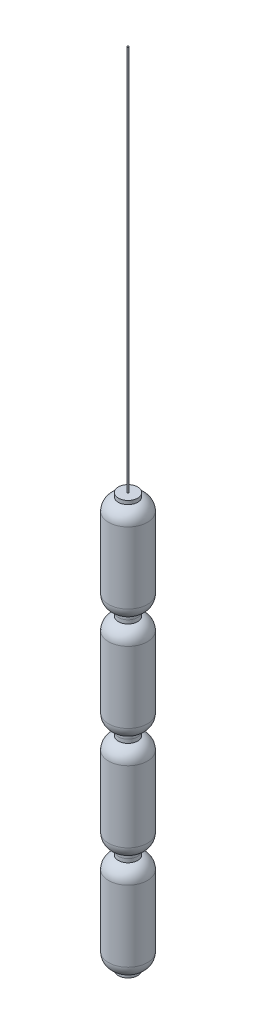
ISO-10303-21;
HEADER;
FILE_DESCRIPTION(('STEP AP214'),'2;1');
FILE_NAME('part.step','',(''),(''),'','','');
FILE_SCHEMA(('AUTOMOTIVE_DESIGN { 1 0 10303 214 1 1 1 1 }'));
ENDSEC;
DATA;
#1=APPLICATION_CONTEXT('core data for automotive mechanical design processes');
#2=APPLICATION_PROTOCOL_DEFINITION('international standard','automotive_design',2000,#1);
#3=PRODUCT_CONTEXT('',#1,'mechanical');
#4=PRODUCT('Part','Part','',(#3));
#5=PRODUCT_RELATED_PRODUCT_CATEGORY('part','',(#4));
#6=PRODUCT_DEFINITION_FORMATION('','',#4);
#7=PRODUCT_DEFINITION_CONTEXT('part definition',#1,'design');
#8=PRODUCT_DEFINITION('design','',#6,#7);
#9=PRODUCT_DEFINITION_SHAPE('','',#8);
#10=(LENGTH_UNIT() NAMED_UNIT(*) SI_UNIT(.MILLI.,.METRE.));
#11=(NAMED_UNIT(*) PLANE_ANGLE_UNIT() SI_UNIT($,.RADIAN.));
#12=(NAMED_UNIT(*) SI_UNIT($,.STERADIAN.) SOLID_ANGLE_UNIT());
#13=UNCERTAINTY_MEASURE_WITH_UNIT(LENGTH_MEASURE(1.E-05),#10,'distance_accuracy_value','');
#14=(GEOMETRIC_REPRESENTATION_CONTEXT(3) GLOBAL_UNCERTAINTY_ASSIGNED_CONTEXT((#13)) GLOBAL_UNIT_ASSIGNED_CONTEXT((#10,
#11,#12)) REPRESENTATION_CONTEXT('',''));
#15=CARTESIAN_POINT('',(0.,0.,0.));
#16=DIRECTION('',(0.,0.,1.));
#17=DIRECTION('',(1.,0.,0.));
#18=AXIS2_PLACEMENT_3D('',#15,#16,#17);
#19=CARTESIAN_POINT('',(0.,2465.,0.));
#20=DIRECTION('',(0.,-1.,0.));
#21=DIRECTION('',(0.,0.,-1.));
#22=AXIS2_PLACEMENT_3D('',#19,#20,#21);
#23=CYLINDRICAL_SURFACE('',#22,2.5);
#24=CARTESIAN_POINT('',(0.,2465.,0.));
#25=DIRECTION('',(0.,1.,0.));
#26=DIRECTION('',(0.,0.,1.));
#27=AXIS2_PLACEMENT_3D('',#24,#25,#26);
#28=CIRCLE('',#27,2.5);
#29=CARTESIAN_POINT('',(0.,2465.,2.5));
#30=VERTEX_POINT('',#29);
#31=EDGE_CURVE('E11',#30,#30,#28,.T.);
#32=ORIENTED_EDGE('',*,*,#31,.F.);
#33=EDGE_LOOP('',(#32));
#34=FACE_BOUND('',#33,.T.);
#35=CARTESIAN_POINT('',(0.,965.,0.));
#36=DIRECTION('',(0.,1.,0.));
#37=DIRECTION('',(0.,0.,1.));
#38=AXIS2_PLACEMENT_3D('',#35,#36,#37);
#39=CIRCLE('',#38,2.5);
#40=CARTESIAN_POINT('',(0.,965.,2.5));
#41=VERTEX_POINT('',#40);
#42=EDGE_CURVE('E53',#41,#41,#39,.T.);
#43=ORIENTED_EDGE('',*,*,#42,.T.);
#44=EDGE_LOOP('',(#43));
#45=FACE_BOUND('',#44,.T.);
#46=ADVANCED_FACE('F50',(#34,#45),#23,.T.);
#47=CARTESIAN_POINT('',(0.,2465.,0.));
#48=DIRECTION('',(0.,1.,0.));
#49=DIRECTION('',(0.,0.,1.));
#50=AXIS2_PLACEMENT_3D('',#47,#48,#49);
#51=PLANE('',#50);
#52=ORIENTED_EDGE('',*,*,#31,.T.);
#53=EDGE_LOOP('',(#52));
#54=FACE_BOUND('',#53,.T.);
#55=ADVANCED_FACE('F65',(#54),#51,.T.);
#56=CARTESIAN_POINT('',(0.,965.,0.));
#57=DIRECTION('',(0.,1.,0.));
#58=DIRECTION('',(0.,0.,1.));
#59=AXIS2_PLACEMENT_3D('',#56,#57,#58);
#60=PLANE('',#59);
#61=ORIENTED_EDGE('',*,*,#42,.F.);
#62=EDGE_LOOP('',(#61));
#63=FACE_BOUND('',#62,.T.);
#64=ADVANCED_FACE('F63',(#63),#60,.F.);
#65=CLOSED_SHELL('',(#46,#55,#64));
#66=MANIFOLD_SOLID_BREP('B2',#65);
#67=CARTESIAN_POINT('',(0.,1270.,0.));
#68=DIRECTION('',(0.,-1.,0.));
#69=DIRECTION('',(0.,0.,-1.));
#70=AXIS2_PLACEMENT_3D('',#67,#68,#69);
#71=CYLINDRICAL_SURFACE('',#70,30.);
#72=CARTESIAN_POINT('',(0.,1270.,0.));
#73=DIRECTION('',(0.,1.,0.));
#74=DIRECTION('',(0.,0.,1.));
#75=AXIS2_PLACEMENT_3D('',#72,#73,#74);
#76=CIRCLE('',#75,30.);
#77=CARTESIAN_POINT('',(0.,1270.,30.));
#78=VERTEX_POINT('',#77);
#79=EDGE_CURVE('E111',#78,#78,#76,.T.);
#80=ORIENTED_EDGE('',*,*,#79,.F.);
#81=EDGE_LOOP('',(#80));
#82=FACE_BOUND('',#81,.T.);
#83=CARTESIAN_POINT('',(0.,1258.72983346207,0.));
#84=DIRECTION('',(0.,-1.,0.));
#85=DIRECTION('',(0.,0.,-1.));
#86=AXIS2_PLACEMENT_3D('',#83,#84,#85);
#87=CIRCLE('',#86,30.);
#88=CARTESIAN_POINT('',(0.,1258.72983346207,-30.));
#89=VERTEX_POINT('',#88);
#90=EDGE_CURVE('E115',#89,#89,#87,.F.);
#91=ORIENTED_EDGE('',*,*,#90,.T.);
#92=EDGE_LOOP('',(#91));
#93=FACE_BOUND('',#92,.T.);
#94=ADVANCED_FACE('F105',(#82,#93),#71,.T.);
#95=CARTESIAN_POINT('',(0.,1270.,0.));
#96=DIRECTION('',(0.,1.,0.));
#97=DIRECTION('',(0.,0.,1.));
#98=AXIS2_PLACEMENT_3D('',#95,#96,#97);
#99=PLANE('',#98);
#100=ORIENTED_EDGE('',*,*,#79,.T.);
#101=EDGE_LOOP('',(#100));
#102=FACE_BOUND('',#101,.T.);
#103=ADVANCED_FACE('F126',(#102),#99,.T.);
#104=CARTESIAN_POINT('',(0.,1220.,0.));
#105=DIRECTION('',(0.,-1.,0.));
#106=DIRECTION('',(0.,0.,-1.));
#107=AXIS2_PLACEMENT_3D('',#104,#105,#106);
#108=DEGENERATE_TOROIDAL_SURFACE('',#107,20.,40.,.T.);
#109=ORIENTED_EDGE('',*,*,#90,.F.);
#110=EDGE_LOOP('',(#109));
#111=FACE_BOUND('',#110,.T.);
#112=CARTESIAN_POINT('',(0.,1260.,0.));
#113=DIRECTION('',(0.,-1.,0.));
#114=DIRECTION('',(0.,0.,-1.));
#115=AXIS2_PLACEMENT_3D('',#112,#113,#114);
#116=CIRCLE('',#115,20.);
#117=CARTESIAN_POINT('',(0.,1260.,-20.));
#118=VERTEX_POINT('',#117);
#119=EDGE_CURVE('E49',#118,#118,#116,.F.);
#120=ORIENTED_EDGE('',*,*,#119,.T.);
#121=EDGE_LOOP('',(#120));
#122=FACE_BOUND('',#121,.T.);
#123=ADVANCED_FACE('F123',(#111,#122),#108,.F.);
#124=CARTESIAN_POINT('',(0.,1260.,0.));
#125=DIRECTION('',(0.,1.,0.));
#126=DIRECTION('',(0.,0.,1.));
#127=AXIS2_PLACEMENT_3D('',#124,#125,#126);
#128=PLANE('',#127);
#129=ORIENTED_EDGE('',*,*,#119,.F.);
#130=EDGE_LOOP('',(#129));
#131=FACE_BOUND('',#130,.T.);
#132=ADVANCED_FACE('F125',(#131),#128,.F.);
#133=CLOSED_SHELL('',(#94,#103,#123,#132));
#134=MANIFOLD_SOLID_BREP('B6',#133);
#135=CARTESIAN_POINT('',(0.,950.,0.));
#136=DIRECTION('',(0.,-1.,0.));
#137=DIRECTION('',(0.,0.,-1.));
#138=AXIS2_PLACEMENT_3D('',#135,#136,#137);
#139=CYLINDRICAL_SURFACE('',#138,30.);
#140=CARTESIAN_POINT('',(0.,950.,0.));
#141=DIRECTION('',(0.,1.,0.));
#142=DIRECTION('',(0.,0.,1.));
#143=AXIS2_PLACEMENT_3D('',#140,#141,#142);
#144=CIRCLE('',#143,30.);
#145=CARTESIAN_POINT('',(0.,950.,30.));
#146=VERTEX_POINT('',#145);
#147=EDGE_CURVE('E180',#146,#146,#144,.T.);
#148=ORIENTED_EDGE('',*,*,#147,.F.);
#149=EDGE_LOOP('',(#148));
#150=FACE_BOUND('',#149,.T.);
#151=CARTESIAN_POINT('',(0.,938.729833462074,0.));
#152=DIRECTION('',(0.,-1.,0.));
#153=DIRECTION('',(0.,0.,-1.));
#154=AXIS2_PLACEMENT_3D('',#151,#152,#153);
#155=CIRCLE('',#154,30.);
#156=CARTESIAN_POINT('',(0.,938.729833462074,-30.));
#157=VERTEX_POINT('',#156);
#158=EDGE_CURVE('E184',#157,#157,#155,.F.);
#159=ORIENTED_EDGE('',*,*,#158,.T.);
#160=EDGE_LOOP('',(#159));
#161=FACE_BOUND('',#160,.T.);
#162=ADVANCED_FACE('F169',(#150,#161),#139,.T.);
#163=CARTESIAN_POINT('',(0.,950.,0.));
#164=DIRECTION('',(0.,1.,0.));
#165=DIRECTION('',(0.,0.,1.));
#166=AXIS2_PLACEMENT_3D('',#163,#164,#165);
#167=PLANE('',#166);
#168=CARTESIAN_POINT('',(0.,950.,0.));
#169=DIRECTION('',(0.,1.,0.));
#170=DIRECTION('',(0.,0.,1.));
#171=AXIS2_PLACEMENT_3D('',#168,#169,#170);
#172=CIRCLE('',#171,5.);
#173=CARTESIAN_POINT('',(0.,950.,5.));
#174=VERTEX_POINT('',#173);
#175=EDGE_CURVE('E104',#174,#174,#172,.T.);
#176=ORIENTED_EDGE('',*,*,#175,.F.);
#177=EDGE_LOOP('',(#176));
#178=FACE_BOUND('',#177,.T.);
#179=ORIENTED_EDGE('',*,*,#147,.T.);
#180=EDGE_LOOP('',(#179));
#181=FACE_BOUND('',#180,.T.);
#182=ADVANCED_FACE('F189',(#178,#181),#167,.T.);
#183=CARTESIAN_POINT('',(0.,900.,0.));
#184=DIRECTION('',(0.,-1.,0.));
#185=DIRECTION('',(0.,0.,-1.));
#186=AXIS2_PLACEMENT_3D('',#183,#184,#185);
#187=DEGENERATE_TOROIDAL_SURFACE('',#186,20.,40.,.T.);
#188=ORIENTED_EDGE('',*,*,#158,.F.);
#189=EDGE_LOOP('',(#188));
#190=FACE_BOUND('',#189,.T.);
#191=CARTESIAN_POINT('',(0.,940.,0.));
#192=DIRECTION('',(0.,-1.,0.));
#193=DIRECTION('',(0.,0.,-1.));
#194=AXIS2_PLACEMENT_3D('',#191,#192,#193);
#195=CIRCLE('',#194,20.);
#196=CARTESIAN_POINT('',(0.,940.,-20.));
#197=VERTEX_POINT('',#196);
#198=EDGE_CURVE('E172',#197,#197,#195,.F.);
#199=ORIENTED_EDGE('',*,*,#198,.T.);
#200=EDGE_LOOP('',(#199));
#201=FACE_BOUND('',#200,.T.);
#202=ADVANCED_FACE('F195',(#190,#201),#187,.F.);
#203=CARTESIAN_POINT('',(0.,940.,0.));
#204=DIRECTION('',(0.,1.,0.));
#205=DIRECTION('',(0.,0.,1.));
#206=AXIS2_PLACEMENT_3D('',#203,#204,#205);
#207=PLANE('',#206);
#208=ORIENTED_EDGE('',*,*,#198,.F.);
#209=EDGE_LOOP('',(#208));
#210=FACE_BOUND('',#209,.T.);
#211=ADVANCED_FACE('F198',(#210),#207,.F.);
#212=CARTESIAN_POINT('',(0.,965.,0.));
#213=DIRECTION('',(0.,-1.,0.));
#214=DIRECTION('',(0.,0.,-1.));
#215=AXIS2_PLACEMENT_3D('',#212,#213,#214);
#216=CYLINDRICAL_SURFACE('',#215,5.);
#217=CARTESIAN_POINT('',(0.,965.,0.));
#218=DIRECTION('',(0.,1.,0.));
#219=DIRECTION('',(0.,0.,1.));
#220=AXIS2_PLACEMENT_3D('',#217,#218,#219);
#221=CIRCLE('',#220,5.);
#222=CARTESIAN_POINT('',(0.,965.,5.));
#223=VERTEX_POINT('',#222);
#224=EDGE_CURVE('E183',#223,#223,#221,.T.);
#225=ORIENTED_EDGE('',*,*,#224,.F.);
#226=EDGE_LOOP('',(#225));
#227=FACE_BOUND('',#226,.T.);
#228=ORIENTED_EDGE('',*,*,#175,.T.);
#229=EDGE_LOOP('',(#228));
#230=FACE_BOUND('',#229,.T.);
#231=ADVANCED_FACE('F203',(#227,#230),#216,.T.);
#232=CARTESIAN_POINT('',(0.,965.,0.));
#233=DIRECTION('',(0.,1.,0.));
#234=DIRECTION('',(0.,0.,1.));
#235=AXIS2_PLACEMENT_3D('',#232,#233,#234);
#236=PLANE('',#235);
#237=ORIENTED_EDGE('',*,*,#224,.T.);
#238=EDGE_LOOP('',(#237));
#239=FACE_BOUND('',#238,.T.);
#240=ADVANCED_FACE('F207',(#239),#236,.T.);
#241=CLOSED_SHELL('',(#162,#182,#202,#211,#231,#240));
#242=MANIFOLD_SOLID_BREP('B44',#241);
#243=CARTESIAN_POINT('',(0.,630.,0.));
#244=DIRECTION('',(0.,-1.,0.));
#245=DIRECTION('',(0.,0.,-1.));
#246=AXIS2_PLACEMENT_3D('',#243,#244,#245);
#247=CYLINDRICAL_SURFACE('',#246,30.);
#248=CARTESIAN_POINT('',(0.,630.,0.));
#249=DIRECTION('',(0.,1.,0.));
#250=DIRECTION('',(0.,0.,1.));
#251=AXIS2_PLACEMENT_3D('',#248,#249,#250);
#252=CIRCLE('',#251,30.);
#253=CARTESIAN_POINT('',(0.,630.,30.));
#254=VERTEX_POINT('',#253);
#255=EDGE_CURVE('E273',#254,#254,#252,.T.);
#256=ORIENTED_EDGE('',*,*,#255,.F.);
#257=EDGE_LOOP('',(#256));
#258=FACE_BOUND('',#257,.T.);
#259=CARTESIAN_POINT('',(0.,618.729833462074,0.));
#260=DIRECTION('',(0.,-1.,0.));
#261=DIRECTION('',(0.,0.,-1.));
#262=AXIS2_PLACEMENT_3D('',#259,#260,#261);
#263=CIRCLE('',#262,30.);
#264=CARTESIAN_POINT('',(0.,618.729833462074,-30.));
#265=VERTEX_POINT('',#264);
#266=EDGE_CURVE('E277',#265,#265,#263,.F.);
#267=ORIENTED_EDGE('',*,*,#266,.T.);
#268=EDGE_LOOP('',(#267));
#269=FACE_BOUND('',#268,.T.);
#270=ADVANCED_FACE('F267',(#258,#269),#247,.T.);
#271=CARTESIAN_POINT('',(0.,630.,0.));
#272=DIRECTION('',(0.,1.,0.));
#273=DIRECTION('',(0.,0.,1.));
#274=AXIS2_PLACEMENT_3D('',#271,#272,#273);
#275=PLANE('',#274);
#276=ORIENTED_EDGE('',*,*,#255,.T.);
#277=EDGE_LOOP('',(#276));
#278=FACE_BOUND('',#277,.T.);
#279=ADVANCED_FACE('F288',(#278),#275,.T.);
#280=CARTESIAN_POINT('',(0.,580.,0.));
#281=DIRECTION('',(0.,-1.,0.));
#282=DIRECTION('',(0.,0.,-1.));
#283=AXIS2_PLACEMENT_3D('',#280,#281,#282);
#284=DEGENERATE_TOROIDAL_SURFACE('',#283,20.,40.,.T.);
#285=ORIENTED_EDGE('',*,*,#266,.F.);
#286=EDGE_LOOP('',(#285));
#287=FACE_BOUND('',#286,.T.);
#288=CARTESIAN_POINT('',(0.,620.,0.));
#289=DIRECTION('',(0.,-1.,0.));
#290=DIRECTION('',(0.,0.,-1.));
#291=AXIS2_PLACEMENT_3D('',#288,#289,#290);
#292=CIRCLE('',#291,20.);
#293=CARTESIAN_POINT('',(0.,620.,-20.));
#294=VERTEX_POINT('',#293);
#295=EDGE_CURVE('E168',#294,#294,#292,.F.);
#296=ORIENTED_EDGE('',*,*,#295,.T.);
#297=EDGE_LOOP('',(#296));
#298=FACE_BOUND('',#297,.T.);
#299=ADVANCED_FACE('F285',(#287,#298),#284,.F.);
#300=CARTESIAN_POINT('',(0.,620.,0.));
#301=DIRECTION('',(0.,1.,0.));
#302=DIRECTION('',(0.,0.,1.));
#303=AXIS2_PLACEMENT_3D('',#300,#301,#302);
#304=PLANE('',#303);
#305=ORIENTED_EDGE('',*,*,#295,.F.);
#306=EDGE_LOOP('',(#305));
#307=FACE_BOUND('',#306,.T.);
#308=ADVANCED_FACE('F287',(#307),#304,.F.);
#309=CLOSED_SHELL('',(#270,#279,#299,#308));
#310=MANIFOLD_SOLID_BREP('B99',#309);
#311=CARTESIAN_POINT('',(-20.,1260.,0.));
#312=DIRECTION('',(0.,-1.,0.));
#313=DIRECTION('',(0.,0.,-1.));
#314=AXIS2_PLACEMENT_3D('',#311,#312,#313);
#315=PLANE('',#314);
#316=CARTESIAN_POINT('',(0.,1260.,0.));
#317=DIRECTION('',(0.,-1.,0.));
#318=DIRECTION('',(0.,0.,-1.));
#319=AXIS2_PLACEMENT_3D('',#316,#317,#318);
#320=CIRCLE('',#319,20.);
#321=CARTESIAN_POINT('',(0.,1260.,-20.));
#322=VERTEX_POINT('',#321);
#323=EDGE_CURVE('E266',#322,#322,#320,.T.);
#324=ORIENTED_EDGE('',*,*,#323,.F.);
#325=EDGE_LOOP('',(#324));
#326=FACE_BOUND('',#325,.T.);
#327=ADVANCED_FACE('F331',(#326),#315,.F.);
#328=CARTESIAN_POINT('',(0.,1220.,0.));
#329=DIRECTION('',(0.,-1.,0.));
#330=DIRECTION('',(0.,0.,-1.));
#331=AXIS2_PLACEMENT_3D('',#328,#329,#330);
#332=DEGENERATE_TOROIDAL_SURFACE('',#331,20.,40.,.T.);
#333=CARTESIAN_POINT('',(0.,1220.,0.));
#334=DIRECTION('',(0.,-1.,0.));
#335=DIRECTION('',(0.,0.,-1.));
#336=AXIS2_PLACEMENT_3D('',#333,#334,#335);
#337=CIRCLE('',#336,60.);
#338=CARTESIAN_POINT('',(0.,1220.,-60.));
#339=VERTEX_POINT('',#338);
#340=EDGE_CURVE('E337',#339,#339,#337,.T.);
#341=ORIENTED_EDGE('',*,*,#340,.F.);
#342=EDGE_LOOP('',(#341));
#343=FACE_BOUND('',#342,.T.);
#344=ORIENTED_EDGE('',*,*,#323,.T.);
#345=EDGE_LOOP('',(#344));
#346=FACE_BOUND('',#345,.T.);
#347=ADVANCED_FACE('F374',(#343,#346),#332,.T.);
#348=CARTESIAN_POINT('',(0.,960.,0.));
#349=DIRECTION('',(0.,-1.,0.));
#350=DIRECTION('',(0.,0.,-1.));
#351=AXIS2_PLACEMENT_3D('',#348,#349,#350);
#352=CYLINDRICAL_SURFACE('',#351,60.);
#353=CARTESIAN_POINT('',(0.,1000.,0.));
#354=DIRECTION('',(0.,-1.,0.));
#355=DIRECTION('',(0.,0.,-1.));
#356=AXIS2_PLACEMENT_3D('',#353,#354,#355);
#357=CIRCLE('',#356,60.);
#358=CARTESIAN_POINT('',(0.,1000.,-60.));
#359=VERTEX_POINT('',#358);
#360=EDGE_CURVE('E341',#359,#359,#357,.T.);
#361=ORIENTED_EDGE('',*,*,#360,.F.);
#362=EDGE_LOOP('',(#361));
#363=FACE_BOUND('',#362,.T.);
#364=ORIENTED_EDGE('',*,*,#340,.T.);
#365=EDGE_LOOP('',(#364));
#366=FACE_BOUND('',#365,.T.);
#367=ADVANCED_FACE('F369',(#363,#366),#352,.T.);
#368=CARTESIAN_POINT('',(0.,1000.,0.));
#369=DIRECTION('',(0.,-1.,0.));
#370=DIRECTION('',(0.,0.,-1.));
#371=AXIS2_PLACEMENT_3D('',#368,#369,#370);
#372=DEGENERATE_TOROIDAL_SURFACE('',#371,20.,40.,.T.);
#373=CARTESIAN_POINT('',(0.,960.,0.));
#374=DIRECTION('',(0.,-1.,0.));
#375=DIRECTION('',(0.,0.,-1.));
#376=AXIS2_PLACEMENT_3D('',#373,#374,#375);
#377=CIRCLE('',#376,20.);
#378=CARTESIAN_POINT('',(0.,960.,-20.));
#379=VERTEX_POINT('',#378);
#380=EDGE_CURVE('E355',#379,#379,#377,.T.);
#381=ORIENTED_EDGE('',*,*,#380,.F.);
#382=EDGE_LOOP('',(#381));
#383=FACE_BOUND('',#382,.T.);
#384=ORIENTED_EDGE('',*,*,#360,.T.);
#385=EDGE_LOOP('',(#384));
#386=FACE_BOUND('',#385,.T.);
#387=ADVANCED_FACE('F366',(#383,#386),#372,.T.);
#388=CARTESIAN_POINT('',(0.,960.,0.));
#389=DIRECTION('',(0.,1.,0.));
#390=DIRECTION('',(0.,0.,1.));
#391=AXIS2_PLACEMENT_3D('',#388,#389,#390);
#392=CYLINDRICAL_SURFACE('',#391,20.);
#393=ORIENTED_EDGE('',*,*,#380,.T.);
#394=EDGE_LOOP('',(#393));
#395=FACE_BOUND('',#394,.T.);
#396=CARTESIAN_POINT('',(0.,968.,0.));
#397=DIRECTION('',(0.,1.,0.));
#398=DIRECTION('',(0.,0.,1.));
#399=AXIS2_PLACEMENT_3D('',#396,#397,#398);
#400=CIRCLE('',#399,20.);
#401=CARTESIAN_POINT('',(0.,968.,20.));
#402=VERTEX_POINT('',#401);
#403=EDGE_CURVE('E345',#402,#402,#400,.F.);
#404=ORIENTED_EDGE('',*,*,#403,.F.);
#405=EDGE_LOOP('',(#404));
#406=FACE_BOUND('',#405,.T.);
#407=ADVANCED_FACE('F363',(#395,#406),#392,.F.);
#408=CARTESIAN_POINT('',(-20.,1252.,0.));
#409=DIRECTION('',(0.,-1.,0.));
#410=DIRECTION('',(0.,0.,-1.));
#411=AXIS2_PLACEMENT_3D('',#408,#409,#410);
#412=PLANE('',#411);
#413=CARTESIAN_POINT('',(0.,1252.,0.));
#414=DIRECTION('',(0.,-1.,0.));
#415=DIRECTION('',(0.,0.,-1.));
#416=AXIS2_PLACEMENT_3D('',#413,#414,#415);
#417=CIRCLE('',#416,20.);
#418=CARTESIAN_POINT('',(0.,1252.,-20.));
#419=VERTEX_POINT('',#418);
#420=EDGE_CURVE('E350',#419,#419,#417,.T.);
#421=ORIENTED_EDGE('',*,*,#420,.T.);
#422=EDGE_LOOP('',(#421));
#423=FACE_BOUND('',#422,.T.);
#424=ADVANCED_FACE('F407',(#423),#412,.T.);
#425=CARTESIAN_POINT('',(0.,1220.,0.));
#426=DIRECTION('',(0.,-1.,0.));
#427=DIRECTION('',(0.,0.,-1.));
#428=AXIS2_PLACEMENT_3D('',#425,#426,#427);
#429=DEGENERATE_TOROIDAL_SURFACE('',#428,20.,32.,.T.);
#430=CARTESIAN_POINT('',(0.,1220.,0.));
#431=DIRECTION('',(0.,-1.,0.));
#432=DIRECTION('',(0.,0.,-1.));
#433=AXIS2_PLACEMENT_3D('',#430,#431,#432);
#434=CIRCLE('',#433,52.);
#435=CARTESIAN_POINT('',(0.,1220.,-52.));
#436=VERTEX_POINT('',#435);
#437=EDGE_CURVE('E354',#436,#436,#434,.T.);
#438=ORIENTED_EDGE('',*,*,#437,.T.);
#439=EDGE_LOOP('',(#438));
#440=FACE_BOUND('',#439,.T.);
#441=ORIENTED_EDGE('',*,*,#420,.F.);
#442=EDGE_LOOP('',(#441));
#443=FACE_BOUND('',#442,.T.);
#444=ADVANCED_FACE('F416',(#440,#443),#429,.F.);
#445=CARTESIAN_POINT('',(0.,960.,0.));
#446=DIRECTION('',(0.,-1.,0.));
#447=DIRECTION('',(0.,0.,-1.));
#448=AXIS2_PLACEMENT_3D('',#445,#446,#447);
#449=CYLINDRICAL_SURFACE('',#448,52.);
#450=CARTESIAN_POINT('',(0.,1000.,0.));
#451=DIRECTION('',(0.,-1.,0.));
#452=DIRECTION('',(0.,0.,-1.));
#453=AXIS2_PLACEMENT_3D('',#450,#451,#452);
#454=CIRCLE('',#453,52.);
#455=CARTESIAN_POINT('',(0.,1000.,-52.));
#456=VERTEX_POINT('',#455);
#457=EDGE_CURVE('E351',#456,#456,#454,.T.);
#458=ORIENTED_EDGE('',*,*,#457,.T.);
#459=EDGE_LOOP('',(#458));
#460=FACE_BOUND('',#459,.T.);
#461=ORIENTED_EDGE('',*,*,#437,.F.);
#462=EDGE_LOOP('',(#461));
#463=FACE_BOUND('',#462,.T.);
#464=ADVANCED_FACE('F426',(#460,#463),#449,.F.);
#465=CARTESIAN_POINT('',(0.,1000.,0.));
#466=DIRECTION('',(0.,-1.,0.));
#467=DIRECTION('',(0.,0.,-1.));
#468=AXIS2_PLACEMENT_3D('',#465,#466,#467);
#469=DEGENERATE_TOROIDAL_SURFACE('',#468,20.,32.,.T.);
#470=ORIENTED_EDGE('',*,*,#403,.T.);
#471=EDGE_LOOP('',(#470));
#472=FACE_BOUND('',#471,.T.);
#473=ORIENTED_EDGE('',*,*,#457,.F.);
#474=EDGE_LOOP('',(#473));
#475=FACE_BOUND('',#474,.T.);
#476=ADVANCED_FACE('F436',(#472,#475),#469,.F.);
#477=CLOSED_SHELL('',(#327,#347,#367,#387,#407,#424,#444,#464,#476));
#478=MANIFOLD_SOLID_BREP('B163',#477);
#479=CARTESIAN_POINT('',(-20.,940.,0.));
#480=DIRECTION('',(0.,-1.,0.));
#481=DIRECTION('',(0.,0.,-1.));
#482=AXIS2_PLACEMENT_3D('',#479,#480,#481);
#483=PLANE('',#482);
#484=CARTESIAN_POINT('',(0.,940.,0.));
#485=DIRECTION('',(0.,-1.,0.));
#486=DIRECTION('',(0.,0.,-1.));
#487=AXIS2_PLACEMENT_3D('',#484,#485,#486);
#488=CIRCLE('',#487,20.);
#489=CARTESIAN_POINT('',(0.,940.,-20.));
#490=VERTEX_POINT('',#489);
#491=EDGE_CURVE('E330',#490,#490,#488,.T.);
#492=ORIENTED_EDGE('',*,*,#491,.F.);
#493=EDGE_LOOP('',(#492));
#494=FACE_BOUND('',#493,.T.);
#495=ADVANCED_FACE('F470',(#494),#483,.F.);
#496=CARTESIAN_POINT('',(0.,900.,0.));
#497=DIRECTION('',(0.,-1.,0.));
#498=DIRECTION('',(0.,0.,-1.));
#499=AXIS2_PLACEMENT_3D('',#496,#497,#498);
#500=DEGENERATE_TOROIDAL_SURFACE('',#499,20.,40.,.T.);
#501=CARTESIAN_POINT('',(0.,900.,0.));
#502=DIRECTION('',(0.,-1.,0.));
#503=DIRECTION('',(0.,0.,-1.));
#504=AXIS2_PLACEMENT_3D('',#501,#502,#503);
#505=CIRCLE('',#504,60.);
#506=CARTESIAN_POINT('',(0.,900.,-60.));
#507=VERTEX_POINT('',#506);
#508=EDGE_CURVE('E476',#507,#507,#505,.T.);
#509=ORIENTED_EDGE('',*,*,#508,.F.);
#510=EDGE_LOOP('',(#509));
#511=FACE_BOUND('',#510,.T.);
#512=ORIENTED_EDGE('',*,*,#491,.T.);
#513=EDGE_LOOP('',(#512));
#514=FACE_BOUND('',#513,.T.);
#515=ADVANCED_FACE('F513',(#511,#514),#500,.T.);
#516=CARTESIAN_POINT('',(0.,640.,0.));
#517=DIRECTION('',(0.,-1.,0.));
#518=DIRECTION('',(0.,0.,-1.));
#519=AXIS2_PLACEMENT_3D('',#516,#517,#518);
#520=CYLINDRICAL_SURFACE('',#519,60.);
#521=CARTESIAN_POINT('',(0.,680.,0.));
#522=DIRECTION('',(0.,-1.,0.));
#523=DIRECTION('',(0.,0.,-1.));
#524=AXIS2_PLACEMENT_3D('',#521,#522,#523);
#525=CIRCLE('',#524,60.);
#526=CARTESIAN_POINT('',(0.,680.,-60.));
#527=VERTEX_POINT('',#526);
#528=EDGE_CURVE('E480',#527,#527,#525,.T.);
#529=ORIENTED_EDGE('',*,*,#528,.F.);
#530=EDGE_LOOP('',(#529));
#531=FACE_BOUND('',#530,.T.);
#532=ORIENTED_EDGE('',*,*,#508,.T.);
#533=EDGE_LOOP('',(#532));
#534=FACE_BOUND('',#533,.T.);
#535=ADVANCED_FACE('F508',(#531,#534),#520,.T.);
#536=CARTESIAN_POINT('',(0.,680.,0.));
#537=DIRECTION('',(0.,-1.,0.));
#538=DIRECTION('',(0.,0.,-1.));
#539=AXIS2_PLACEMENT_3D('',#536,#537,#538);
#540=DEGENERATE_TOROIDAL_SURFACE('',#539,20.,40.,.T.);
#541=CARTESIAN_POINT('',(0.,640.,0.));
#542=DIRECTION('',(0.,-1.,0.));
#543=DIRECTION('',(0.,0.,-1.));
#544=AXIS2_PLACEMENT_3D('',#541,#542,#543);
#545=CIRCLE('',#544,20.);
#546=CARTESIAN_POINT('',(0.,640.,-20.));
#547=VERTEX_POINT('',#546);
#548=EDGE_CURVE('E494',#547,#547,#545,.T.);
#549=ORIENTED_EDGE('',*,*,#548,.F.);
#550=EDGE_LOOP('',(#549));
#551=FACE_BOUND('',#550,.T.);
#552=ORIENTED_EDGE('',*,*,#528,.T.);
#553=EDGE_LOOP('',(#552));
#554=FACE_BOUND('',#553,.T.);
#555=ADVANCED_FACE('F505',(#551,#554),#540,.T.);
#556=CARTESIAN_POINT('',(0.,640.,0.));
#557=DIRECTION('',(0.,1.,0.));
#558=DIRECTION('',(0.,0.,1.));
#559=AXIS2_PLACEMENT_3D('',#556,#557,#558);
#560=CYLINDRICAL_SURFACE('',#559,20.);
#561=ORIENTED_EDGE('',*,*,#548,.T.);
#562=EDGE_LOOP('',(#561));
#563=FACE_BOUND('',#562,.T.);
#564=CARTESIAN_POINT('',(0.,648.,0.));
#565=DIRECTION('',(0.,1.,0.));
#566=DIRECTION('',(0.,0.,1.));
#567=AXIS2_PLACEMENT_3D('',#564,#565,#566);
#568=CIRCLE('',#567,20.);
#569=CARTESIAN_POINT('',(0.,648.,20.));
#570=VERTEX_POINT('',#569);
#571=EDGE_CURVE('E484',#570,#570,#568,.F.);
#572=ORIENTED_EDGE('',*,*,#571,.F.);
#573=EDGE_LOOP('',(#572));
#574=FACE_BOUND('',#573,.T.);
#575=ADVANCED_FACE('F502',(#563,#574),#560,.F.);
#576=CARTESIAN_POINT('',(-20.,932.,0.));
#577=DIRECTION('',(0.,-1.,0.));
#578=DIRECTION('',(0.,0.,-1.));
#579=AXIS2_PLACEMENT_3D('',#576,#577,#578);
#580=PLANE('',#579);
#581=CARTESIAN_POINT('',(0.,932.,0.));
#582=DIRECTION('',(0.,-1.,0.));
#583=DIRECTION('',(0.,0.,-1.));
#584=AXIS2_PLACEMENT_3D('',#581,#582,#583);
#585=CIRCLE('',#584,20.);
#586=CARTESIAN_POINT('',(0.,932.,-20.));
#587=VERTEX_POINT('',#586);
#588=EDGE_CURVE('E489',#587,#587,#585,.T.);
#589=ORIENTED_EDGE('',*,*,#588,.T.);
#590=EDGE_LOOP('',(#589));
#591=FACE_BOUND('',#590,.T.);
#592=ADVANCED_FACE('F546',(#591),#580,.T.);
#593=CARTESIAN_POINT('',(0.,900.,0.));
#594=DIRECTION('',(0.,-1.,0.));
#595=DIRECTION('',(0.,0.,-1.));
#596=AXIS2_PLACEMENT_3D('',#593,#594,#595);
#597=DEGENERATE_TOROIDAL_SURFACE('',#596,20.,32.,.T.);
#598=CARTESIAN_POINT('',(0.,900.,0.));
#599=DIRECTION('',(0.,-1.,0.));
#600=DIRECTION('',(0.,0.,-1.));
#601=AXIS2_PLACEMENT_3D('',#598,#599,#600);
#602=CIRCLE('',#601,52.);
#603=CARTESIAN_POINT('',(0.,900.,-52.));
#604=VERTEX_POINT('',#603);
#605=EDGE_CURVE('E493',#604,#604,#602,.T.);
#606=ORIENTED_EDGE('',*,*,#605,.T.);
#607=EDGE_LOOP('',(#606));
#608=FACE_BOUND('',#607,.T.);
#609=ORIENTED_EDGE('',*,*,#588,.F.);
#610=EDGE_LOOP('',(#609));
#611=FACE_BOUND('',#610,.T.);
#612=ADVANCED_FACE('F555',(#608,#611),#597,.F.);
#613=CARTESIAN_POINT('',(0.,640.,0.));
#614=DIRECTION('',(0.,-1.,0.));
#615=DIRECTION('',(0.,0.,-1.));
#616=AXIS2_PLACEMENT_3D('',#613,#614,#615);
#617=CYLINDRICAL_SURFACE('',#616,52.);
#618=CARTESIAN_POINT('',(0.,680.,0.));
#619=DIRECTION('',(0.,-1.,0.));
#620=DIRECTION('',(0.,0.,-1.));
#621=AXIS2_PLACEMENT_3D('',#618,#619,#620);
#622=CIRCLE('',#621,52.);
#623=CARTESIAN_POINT('',(0.,680.,-52.));
#624=VERTEX_POINT('',#623);
#625=EDGE_CURVE('E490',#624,#624,#622,.T.);
#626=ORIENTED_EDGE('',*,*,#625,.T.);
#627=EDGE_LOOP('',(#626));
#628=FACE_BOUND('',#627,.T.);
#629=ORIENTED_EDGE('',*,*,#605,.F.);
#630=EDGE_LOOP('',(#629));
#631=FACE_BOUND('',#630,.T.);
#632=ADVANCED_FACE('F565',(#628,#631),#617,.F.);
#633=CARTESIAN_POINT('',(0.,680.,0.));
#634=DIRECTION('',(0.,-1.,0.));
#635=DIRECTION('',(0.,0.,-1.));
#636=AXIS2_PLACEMENT_3D('',#633,#634,#635);
#637=DEGENERATE_TOROIDAL_SURFACE('',#636,20.,32.,.T.);
#638=ORIENTED_EDGE('',*,*,#571,.T.);
#639=EDGE_LOOP('',(#638));
#640=FACE_BOUND('',#639,.T.);
#641=ORIENTED_EDGE('',*,*,#625,.F.);
#642=EDGE_LOOP('',(#641));
#643=FACE_BOUND('',#642,.T.);
#644=ADVANCED_FACE('F575',(#640,#643),#637,.F.);
#645=CLOSED_SHELL('',(#495,#515,#535,#555,#575,#592,#612,#632,#644));
#646=MANIFOLD_SOLID_BREP('B261',#645);
#647=CARTESIAN_POINT('',(-20.,620.,0.));
#648=DIRECTION('',(0.,-1.,0.));
#649=DIRECTION('',(0.,0.,-1.));
#650=AXIS2_PLACEMENT_3D('',#647,#648,#649);
#651=PLANE('',#650);
#652=CARTESIAN_POINT('',(0.,620.,0.));
#653=DIRECTION('',(0.,-1.,0.));
#654=DIRECTION('',(0.,0.,-1.));
#655=AXIS2_PLACEMENT_3D('',#652,#653,#654);
#656=CIRCLE('',#655,20.);
#657=CARTESIAN_POINT('',(0.,620.,-20.));
#658=VERTEX_POINT('',#657);
#659=EDGE_CURVE('E469',#658,#658,#656,.T.);
#660=ORIENTED_EDGE('',*,*,#659,.F.);
#661=EDGE_LOOP('',(#660));
#662=FACE_BOUND('',#661,.T.);
#663=ADVANCED_FACE('F609',(#662),#651,.F.);
#664=CARTESIAN_POINT('',(0.,580.,0.));
#665=DIRECTION('',(0.,-1.,0.));
#666=DIRECTION('',(0.,0.,-1.));
#667=AXIS2_PLACEMENT_3D('',#664,#665,#666);
#668=DEGENERATE_TOROIDAL_SURFACE('',#667,20.,40.,.T.);
#669=CARTESIAN_POINT('',(0.,580.,0.));
#670=DIRECTION('',(0.,-1.,0.));
#671=DIRECTION('',(0.,0.,-1.));
#672=AXIS2_PLACEMENT_3D('',#669,#670,#671);
#673=CIRCLE('',#672,60.);
#674=CARTESIAN_POINT('',(0.,580.,-60.));
#675=VERTEX_POINT('',#674);
#676=EDGE_CURVE('E616',#675,#675,#673,.T.);
#677=ORIENTED_EDGE('',*,*,#676,.F.);
#678=EDGE_LOOP('',(#677));
#679=FACE_BOUND('',#678,.T.);
#680=ORIENTED_EDGE('',*,*,#659,.T.);
#681=EDGE_LOOP('',(#680));
#682=FACE_BOUND('',#681,.T.);
#683=ADVANCED_FACE('F660',(#679,#682),#668,.T.);
#684=CARTESIAN_POINT('',(0.,320.,0.));
#685=DIRECTION('',(0.,-1.,0.));
#686=DIRECTION('',(0.,0.,-1.));
#687=AXIS2_PLACEMENT_3D('',#684,#685,#686);
#688=CYLINDRICAL_SURFACE('',#687,60.);
#689=CARTESIAN_POINT('',(0.,360.,0.));
#690=DIRECTION('',(0.,-1.,0.));
#691=DIRECTION('',(0.,0.,-1.));
#692=AXIS2_PLACEMENT_3D('',#689,#690,#691);
#693=CIRCLE('',#692,60.);
#694=CARTESIAN_POINT('',(0.,360.,-60.));
#695=VERTEX_POINT('',#694);
#696=EDGE_CURVE('E621',#695,#695,#693,.T.);
#697=ORIENTED_EDGE('',*,*,#696,.F.);
#698=EDGE_LOOP('',(#697));
#699=FACE_BOUND('',#698,.T.);
#700=ORIENTED_EDGE('',*,*,#676,.T.);
#701=EDGE_LOOP('',(#700));
#702=FACE_BOUND('',#701,.T.);
#703=ADVANCED_FACE('F655',(#699,#702),#688,.T.);
#704=CARTESIAN_POINT('',(0.,360.,0.));
#705=DIRECTION('',(0.,-1.,0.));
#706=DIRECTION('',(0.,0.,-1.));
#707=AXIS2_PLACEMENT_3D('',#704,#705,#706);
#708=DEGENERATE_TOROIDAL_SURFACE('',#707,20.,40.,.T.);
#709=CARTESIAN_POINT('',(0.,320.,0.));
#710=DIRECTION('',(0.,-1.,0.));
#711=DIRECTION('',(0.,0.,-1.));
#712=AXIS2_PLACEMENT_3D('',#709,#710,#711);
#713=CIRCLE('',#712,20.);
#714=CARTESIAN_POINT('',(0.,320.,-20.));
#715=VERTEX_POINT('',#714);
#716=EDGE_CURVE('E638',#715,#715,#713,.T.);
#717=ORIENTED_EDGE('',*,*,#716,.F.);
#718=EDGE_LOOP('',(#717));
#719=FACE_BOUND('',#718,.T.);
#720=ORIENTED_EDGE('',*,*,#696,.T.);
#721=EDGE_LOOP('',(#720));
#722=FACE_BOUND('',#721,.T.);
#723=ADVANCED_FACE('F652',(#719,#722),#708,.T.);
#724=CARTESIAN_POINT('',(0.,320.,0.));
#725=DIRECTION('',(0.,1.,0.));
#726=DIRECTION('',(0.,0.,1.));
#727=AXIS2_PLACEMENT_3D('',#724,#725,#726);
#728=CYLINDRICAL_SURFACE('',#727,20.);
#729=ORIENTED_EDGE('',*,*,#716,.T.);
#730=EDGE_LOOP('',(#729));
#731=FACE_BOUND('',#730,.T.);
#732=CARTESIAN_POINT('',(0.,328.,0.));
#733=DIRECTION('',(0.,1.,0.));
#734=DIRECTION('',(0.,0.,1.));
#735=AXIS2_PLACEMENT_3D('',#732,#733,#734);
#736=CIRCLE('',#735,20.);
#737=CARTESIAN_POINT('',(0.,328.,20.));
#738=VERTEX_POINT('',#737);
#739=EDGE_CURVE('E626',#738,#738,#736,.F.);
#740=ORIENTED_EDGE('',*,*,#739,.F.);
#741=EDGE_LOOP('',(#740));
#742=FACE_BOUND('',#741,.T.);
#743=ADVANCED_FACE('F649',(#731,#742),#728,.F.);
#744=CARTESIAN_POINT('',(-20.,612.,0.));
#745=DIRECTION('',(0.,-1.,0.));
#746=DIRECTION('',(0.,0.,-1.));
#747=AXIS2_PLACEMENT_3D('',#744,#745,#746);
#748=PLANE('',#747);
#749=CARTESIAN_POINT('',(0.,612.,0.));
#750=DIRECTION('',(0.,-1.,0.));
#751=DIRECTION('',(0.,0.,-1.));
#752=AXIS2_PLACEMENT_3D('',#749,#750,#751);
#753=CIRCLE('',#752,20.);
#754=CARTESIAN_POINT('',(0.,612.,-20.));
#755=VERTEX_POINT('',#754);
#756=EDGE_CURVE('E632',#755,#755,#753,.T.);
#757=ORIENTED_EDGE('',*,*,#756,.T.);
#758=EDGE_LOOP('',(#757));
#759=FACE_BOUND('',#758,.T.);
#760=ADVANCED_FACE('F693',(#759),#748,.T.);
#761=CARTESIAN_POINT('',(0.,580.,0.));
#762=DIRECTION('',(0.,-1.,0.));
#763=DIRECTION('',(0.,0.,-1.));
#764=AXIS2_PLACEMENT_3D('',#761,#762,#763);
#765=DEGENERATE_TOROIDAL_SURFACE('',#764,20.,32.,.T.);
#766=CARTESIAN_POINT('',(0.,580.,0.));
#767=DIRECTION('',(0.,-1.,0.));
#768=DIRECTION('',(0.,0.,-1.));
#769=AXIS2_PLACEMENT_3D('',#766,#767,#768);
#770=CIRCLE('',#769,52.);
#771=CARTESIAN_POINT('',(0.,580.,-52.));
#772=VERTEX_POINT('',#771);
#773=EDGE_CURVE('E637',#772,#772,#770,.T.);
#774=ORIENTED_EDGE('',*,*,#773,.T.);
#775=EDGE_LOOP('',(#774));
#776=FACE_BOUND('',#775,.T.);
#777=ORIENTED_EDGE('',*,*,#756,.F.);
#778=EDGE_LOOP('',(#777));
#779=FACE_BOUND('',#778,.T.);
#780=ADVANCED_FACE('F702',(#776,#779),#765,.F.);
#781=CARTESIAN_POINT('',(0.,320.,0.));
#782=DIRECTION('',(0.,-1.,0.));
#783=DIRECTION('',(0.,0.,-1.));
#784=AXIS2_PLACEMENT_3D('',#781,#782,#783);
#785=CYLINDRICAL_SURFACE('',#784,52.);
#786=CARTESIAN_POINT('',(0.,360.,0.));
#787=DIRECTION('',(0.,-1.,0.));
#788=DIRECTION('',(0.,0.,-1.));
#789=AXIS2_PLACEMENT_3D('',#786,#787,#788);
#790=CIRCLE('',#789,52.);
#791=CARTESIAN_POINT('',(0.,360.,-52.));
#792=VERTEX_POINT('',#791);
#793=EDGE_CURVE('E633',#792,#792,#790,.T.);
#794=ORIENTED_EDGE('',*,*,#793,.T.);
#795=EDGE_LOOP('',(#794));
#796=FACE_BOUND('',#795,.T.);
#797=ORIENTED_EDGE('',*,*,#773,.F.);
#798=EDGE_LOOP('',(#797));
#799=FACE_BOUND('',#798,.T.);
#800=ADVANCED_FACE('F712',(#796,#799),#785,.F.);
#801=CARTESIAN_POINT('',(0.,360.,0.));
#802=DIRECTION('',(0.,-1.,0.));
#803=DIRECTION('',(0.,0.,-1.));
#804=AXIS2_PLACEMENT_3D('',#801,#802,#803);
#805=DEGENERATE_TOROIDAL_SURFACE('',#804,20.,32.,.T.);
#806=ORIENTED_EDGE('',*,*,#739,.T.);
#807=EDGE_LOOP('',(#806));
#808=FACE_BOUND('',#807,.T.);
#809=ORIENTED_EDGE('',*,*,#793,.F.);
#810=EDGE_LOOP('',(#809));
#811=FACE_BOUND('',#810,.T.);
#812=ADVANCED_FACE('F722',(#808,#811),#805,.F.);
#813=CLOSED_SHELL('',(#663,#683,#703,#723,#743,#760,#780,#800,#812));
#814=MANIFOLD_SOLID_BREP('B325',#813);
#815=CARTESIAN_POINT('',(0.,950.,0.));
#816=DIRECTION('',(0.,1.,0.));
#817=DIRECTION('',(0.,0.,-1.));
#818=AXIS2_PLACEMENT_3D('',#815,#816,#817);
#819=CYLINDRICAL_SURFACE('',#818,30.);
#820=CARTESIAN_POINT('',(0.,950.,0.));
#821=DIRECTION('',(0.,1.,0.));
#822=DIRECTION('',(0.,0.,1.));
#823=AXIS2_PLACEMENT_3D('',#820,#821,#822);
#824=CIRCLE('',#823,30.);
#825=CARTESIAN_POINT('',(0.,950.,30.));
#826=VERTEX_POINT('',#825);
#827=EDGE_CURVE('E762',#826,#826,#824,.T.);
#828=ORIENTED_EDGE('',*,*,#827,.T.);
#829=EDGE_LOOP('',(#828));
#830=FACE_BOUND('',#829,.T.);
#831=CARTESIAN_POINT('',(0.,961.270166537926,0.));
#832=DIRECTION('',(0.,-1.,0.));
#833=DIRECTION('',(0.,0.,-1.));
#834=AXIS2_PLACEMENT_3D('',#831,#832,#833);
#835=CIRCLE('',#834,30.);
#836=CARTESIAN_POINT('',(0.,961.270166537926,-30.));
#837=VERTEX_POINT('',#836);
#838=EDGE_CURVE('E766',#837,#837,#835,.F.);
#839=ORIENTED_EDGE('',*,*,#838,.F.);
#840=EDGE_LOOP('',(#839));
#841=FACE_BOUND('',#840,.T.);
#842=ADVANCED_FACE('F756',(#830,#841),#819,.T.);
#843=CARTESIAN_POINT('',(0.,950.,0.));
#844=DIRECTION('',(0.,-1.,0.));
#845=DIRECTION('',(0.,0.,1.));
#846=AXIS2_PLACEMENT_3D('',#843,#844,#845);
#847=PLANE('',#846);
#848=ORIENTED_EDGE('',*,*,#827,.F.);
#849=EDGE_LOOP('',(#848));
#850=FACE_BOUND('',#849,.T.);
#851=ADVANCED_FACE('F777',(#850),#847,.T.);
#852=CARTESIAN_POINT('',(0.,1000.,0.));
#853=DIRECTION('',(0.,1.,0.));
#854=DIRECTION('',(0.,0.,-1.));
#855=AXIS2_PLACEMENT_3D('',#852,#853,#854);
#856=DEGENERATE_TOROIDAL_SURFACE('',#855,20.,40.,.T.);
#857=ORIENTED_EDGE('',*,*,#838,.T.);
#858=EDGE_LOOP('',(#857));
#859=FACE_BOUND('',#858,.T.);
#860=CARTESIAN_POINT('',(0.,960.,0.));
#861=DIRECTION('',(0.,-1.,0.));
#862=DIRECTION('',(0.,0.,-1.));
#863=AXIS2_PLACEMENT_3D('',#860,#861,#862);
#864=CIRCLE('',#863,20.);
#865=CARTESIAN_POINT('',(0.,960.,-20.));
#866=VERTEX_POINT('',#865);
#867=EDGE_CURVE('E608',#866,#866,#864,.F.);
#868=ORIENTED_EDGE('',*,*,#867,.F.);
#869=EDGE_LOOP('',(#868));
#870=FACE_BOUND('',#869,.T.);
#871=ADVANCED_FACE('F773',(#859,#870),#856,.F.);
#872=CARTESIAN_POINT('',(0.,960.,0.));
#873=DIRECTION('',(0.,-1.,0.));
#874=DIRECTION('',(0.,0.,1.));
#875=AXIS2_PLACEMENT_3D('',#872,#873,#874);
#876=PLANE('',#875);
#877=ORIENTED_EDGE('',*,*,#867,.T.);
#878=EDGE_LOOP('',(#877));
#879=FACE_BOUND('',#878,.T.);
#880=ADVANCED_FACE('F786',(#879),#876,.F.);
#881=CLOSED_SHELL('',(#842,#851,#871,#880));
#882=MANIFOLD_SOLID_BREP('B464',#881);
#883=CARTESIAN_POINT('',(0.,630.,0.));
#884=DIRECTION('',(0.,1.,0.));
#885=DIRECTION('',(0.,0.,-1.));
#886=AXIS2_PLACEMENT_3D('',#883,#884,#885);
#887=CYLINDRICAL_SURFACE('',#886,30.);
#888=CARTESIAN_POINT('',(0.,630.,0.));
#889=DIRECTION('',(0.,1.,0.));
#890=DIRECTION('',(0.,0.,1.));
#891=AXIS2_PLACEMENT_3D('',#888,#889,#890);
#892=CIRCLE('',#891,30.);
#893=CARTESIAN_POINT('',(0.,630.,30.));
#894=VERTEX_POINT('',#893);
#895=EDGE_CURVE('E826',#894,#894,#892,.T.);
#896=ORIENTED_EDGE('',*,*,#895,.T.);
#897=EDGE_LOOP('',(#896));
#898=FACE_BOUND('',#897,.T.);
#899=CARTESIAN_POINT('',(0.,641.270166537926,0.));
#900=DIRECTION('',(0.,-1.,0.));
#901=DIRECTION('',(0.,0.,-1.));
#902=AXIS2_PLACEMENT_3D('',#899,#900,#901);
#903=CIRCLE('',#902,30.);
#904=CARTESIAN_POINT('',(0.,641.270166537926,-30.));
#905=VERTEX_POINT('',#904);
#906=EDGE_CURVE('E830',#905,#905,#903,.F.);
#907=ORIENTED_EDGE('',*,*,#906,.F.);
#908=EDGE_LOOP('',(#907));
#909=FACE_BOUND('',#908,.T.);
#910=ADVANCED_FACE('F820',(#898,#909),#887,.T.);
#911=CARTESIAN_POINT('',(0.,630.,0.));
#912=DIRECTION('',(0.,-1.,0.));
#913=DIRECTION('',(0.,0.,1.));
#914=AXIS2_PLACEMENT_3D('',#911,#912,#913);
#915=PLANE('',#914);
#916=ORIENTED_EDGE('',*,*,#895,.F.);
#917=EDGE_LOOP('',(#916));
#918=FACE_BOUND('',#917,.T.);
#919=ADVANCED_FACE('F841',(#918),#915,.T.);
#920=CARTESIAN_POINT('',(0.,680.,0.));
#921=DIRECTION('',(0.,1.,0.));
#922=DIRECTION('',(0.,0.,-1.));
#923=AXIS2_PLACEMENT_3D('',#920,#921,#922);
#924=DEGENERATE_TOROIDAL_SURFACE('',#923,20.,40.,.T.);
#925=ORIENTED_EDGE('',*,*,#906,.T.);
#926=EDGE_LOOP('',(#925));
#927=FACE_BOUND('',#926,.T.);
#928=CARTESIAN_POINT('',(0.,640.,0.));
#929=DIRECTION('',(0.,-1.,0.));
#930=DIRECTION('',(0.,0.,-1.));
#931=AXIS2_PLACEMENT_3D('',#928,#929,#930);
#932=CIRCLE('',#931,20.);
#933=CARTESIAN_POINT('',(0.,640.,-20.));
#934=VERTEX_POINT('',#933);
#935=EDGE_CURVE('E755',#934,#934,#932,.F.);
#936=ORIENTED_EDGE('',*,*,#935,.F.);
#937=EDGE_LOOP('',(#936));
#938=FACE_BOUND('',#937,.T.);
#939=ADVANCED_FACE('F837',(#927,#938),#924,.F.);
#940=CARTESIAN_POINT('',(0.,640.,0.));
#941=DIRECTION('',(0.,-1.,0.));
#942=DIRECTION('',(0.,0.,1.));
#943=AXIS2_PLACEMENT_3D('',#940,#941,#942);
#944=PLANE('',#943);
#945=ORIENTED_EDGE('',*,*,#935,.T.);
#946=EDGE_LOOP('',(#945));
#947=FACE_BOUND('',#946,.T.);
#948=ADVANCED_FACE('F850',(#947),#944,.F.);
#949=CLOSED_SHELL('',(#910,#919,#939,#948));
#950=MANIFOLD_SOLID_BREP('B603',#949);
#951=CARTESIAN_POINT('',(0.,310.,0.));
#952=DIRECTION('',(0.,1.,0.));
#953=DIRECTION('',(0.,0.,-1.));
#954=AXIS2_PLACEMENT_3D('',#951,#952,#953);
#955=CYLINDRICAL_SURFACE('',#954,30.);
#956=CARTESIAN_POINT('',(0.,310.,0.));
#957=DIRECTION('',(0.,1.,0.));
#958=DIRECTION('',(0.,0.,1.));
#959=AXIS2_PLACEMENT_3D('',#956,#957,#958);
#960=CIRCLE('',#959,30.);
#961=CARTESIAN_POINT('',(0.,310.,30.));
#962=VERTEX_POINT('',#961);
#963=EDGE_CURVE('E890',#962,#962,#960,.T.);
#964=ORIENTED_EDGE('',*,*,#963,.T.);
#965=EDGE_LOOP('',(#964));
#966=FACE_BOUND('',#965,.T.);
#967=CARTESIAN_POINT('',(0.,321.270166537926,0.));
#968=DIRECTION('',(0.,-1.,0.));
#969=DIRECTION('',(0.,0.,-1.));
#970=AXIS2_PLACEMENT_3D('',#967,#968,#969);
#971=CIRCLE('',#970,30.);
#972=CARTESIAN_POINT('',(0.,321.270166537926,-30.));
#973=VERTEX_POINT('',#972);
#974=EDGE_CURVE('E894',#973,#973,#971,.F.);
#975=ORIENTED_EDGE('',*,*,#974,.F.);
#976=EDGE_LOOP('',(#975));
#977=FACE_BOUND('',#976,.T.);
#978=ADVANCED_FACE('F884',(#966,#977),#955,.T.);
#979=CARTESIAN_POINT('',(0.,310.,0.));
#980=DIRECTION('',(0.,-1.,0.));
#981=DIRECTION('',(0.,0.,1.));
#982=AXIS2_PLACEMENT_3D('',#979,#980,#981);
#983=PLANE('',#982);
#984=ORIENTED_EDGE('',*,*,#963,.F.);
#985=EDGE_LOOP('',(#984));
#986=FACE_BOUND('',#985,.T.);
#987=ADVANCED_FACE('F905',(#986),#983,.T.);
#988=CARTESIAN_POINT('',(0.,360.,0.));
#989=DIRECTION('',(0.,1.,0.));
#990=DIRECTION('',(0.,0.,-1.));
#991=AXIS2_PLACEMENT_3D('',#988,#989,#990);
#992=DEGENERATE_TOROIDAL_SURFACE('',#991,20.,40.,.T.);
#993=ORIENTED_EDGE('',*,*,#974,.T.);
#994=EDGE_LOOP('',(#993));
#995=FACE_BOUND('',#994,.T.);
#996=CARTESIAN_POINT('',(0.,320.,0.));
#997=DIRECTION('',(0.,-1.,0.));
#998=DIRECTION('',(0.,0.,-1.));
#999=AXIS2_PLACEMENT_3D('',#996,#997,#998);
#1000=CIRCLE('',#999,20.);
#1001=CARTESIAN_POINT('',(0.,320.,-20.));
#1002=VERTEX_POINT('',#1001);
#1003=EDGE_CURVE('E819',#1002,#1002,#1000,.F.);
#1004=ORIENTED_EDGE('',*,*,#1003,.F.);
#1005=EDGE_LOOP('',(#1004));
#1006=FACE_BOUND('',#1005,.T.);
#1007=ADVANCED_FACE('F901',(#995,#1006),#992,.F.);
#1008=CARTESIAN_POINT('',(0.,320.,0.));
#1009=DIRECTION('',(0.,-1.,0.));
#1010=DIRECTION('',(0.,0.,1.));
#1011=AXIS2_PLACEMENT_3D('',#1008,#1009,#1010);
#1012=PLANE('',#1011);
#1013=ORIENTED_EDGE('',*,*,#1003,.T.);
#1014=EDGE_LOOP('',(#1013));
#1015=FACE_BOUND('',#1014,.T.);
#1016=ADVANCED_FACE('F914',(#1015),#1012,.F.);
#1017=CLOSED_SHELL('',(#978,#987,#1007,#1016));
#1018=MANIFOLD_SOLID_BREP('B750',#1017);
#1019=CARTESIAN_POINT('',(0.,5.,0.));
#1020=DIRECTION('',(0.,1.,0.));
#1021=DIRECTION('',(0.,0.,1.));
#1022=AXIS2_PLACEMENT_3D('',#1019,#1020,#1021);
#1023=CYLINDRICAL_SURFACE('',#1022,30.);
#1024=CARTESIAN_POINT('',(0.,5.,0.));
#1025=DIRECTION('',(0.,1.,0.));
#1026=DIRECTION('',(0.,0.,1.));
#1027=AXIS2_PLACEMENT_3D('',#1024,#1025,#1026);
#1028=CIRCLE('',#1027,30.);
#1029=CARTESIAN_POINT('',(0.,5.,30.));
#1030=VERTEX_POINT('',#1029);
#1031=EDGE_CURVE('E883',#1030,#1030,#1028,.T.);
#1032=ORIENTED_EDGE('',*,*,#1031,.T.);
#1033=EDGE_LOOP('',(#1032));
#1034=FACE_BOUND('',#1033,.T.);
#1035=CARTESIAN_POINT('',(0.,295.,0.));
#1036=DIRECTION('',(0.,1.,0.));
#1037=DIRECTION('',(0.,0.,1.));
#1038=AXIS2_PLACEMENT_3D('',#1035,#1036,#1037);
#1039=CIRCLE('',#1038,30.);
#1040=CARTESIAN_POINT('',(0.,295.,30.));
#1041=VERTEX_POINT('',#1040);
#1042=EDGE_CURVE('E954',#1041,#1041,#1039,.T.);
#1043=ORIENTED_EDGE('',*,*,#1042,.F.);
#1044=EDGE_LOOP('',(#1043));
#1045=FACE_BOUND('',#1044,.T.);
#1046=ADVANCED_FACE('F948',(#1034,#1045),#1023,.T.);
#1047=CARTESIAN_POINT('',(0.,5.,0.));
#1048=DIRECTION('',(0.,1.,0.));
#1049=DIRECTION('',(0.,0.,1.));
#1050=AXIS2_PLACEMENT_3D('',#1047,#1048,#1049);
#1051=PLANE('',#1050);
#1052=ORIENTED_EDGE('',*,*,#1031,.F.);
#1053=EDGE_LOOP('',(#1052));
#1054=FACE_BOUND('',#1053,.T.);
#1055=ADVANCED_FACE('F963',(#1054),#1051,.F.);
#1056=CARTESIAN_POINT('',(0.,295.,0.));
#1057=DIRECTION('',(0.,1.,0.));
#1058=DIRECTION('',(0.,0.,1.));
#1059=AXIS2_PLACEMENT_3D('',#1056,#1057,#1058);
#1060=PLANE('',#1059);
#1061=ORIENTED_EDGE('',*,*,#1042,.T.);
#1062=EDGE_LOOP('',(#1061));
#1063=FACE_BOUND('',#1062,.T.);
#1064=ADVANCED_FACE('F960',(#1063),#1060,.T.);
#1065=CLOSED_SHELL('',(#1046,#1055,#1064));
#1066=MANIFOLD_SOLID_BREP('B814',#1065);
#1067=CARTESIAN_POINT('',(0.,-10.,0.));
#1068=DIRECTION('',(0.,1.,0.));
#1069=DIRECTION('',(0.,0.,-1.));
#1070=AXIS2_PLACEMENT_3D('',#1067,#1068,#1069);
#1071=CYLINDRICAL_SURFACE('',#1070,30.);
#1072=CARTESIAN_POINT('',(0.,-10.,0.));
#1073=DIRECTION('',(0.,1.,0.));
#1074=DIRECTION('',(0.,0.,1.));
#1075=AXIS2_PLACEMENT_3D('',#1072,#1073,#1074);
#1076=CIRCLE('',#1075,30.);
#1077=CARTESIAN_POINT('',(0.,-10.,30.));
#1078=VERTEX_POINT('',#1077);
#1079=EDGE_CURVE('E1003',#1078,#1078,#1076,.T.);
#1080=ORIENTED_EDGE('',*,*,#1079,.T.);
#1081=EDGE_LOOP('',(#1080));
#1082=FACE_BOUND('',#1081,.T.);
#1083=CARTESIAN_POINT('',(0.,1.27016653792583,0.));
#1084=DIRECTION('',(0.,-1.,0.));
#1085=DIRECTION('',(0.,0.,-1.));
#1086=AXIS2_PLACEMENT_3D('',#1083,#1084,#1085);
#1087=CIRCLE('',#1086,30.);
#1088=CARTESIAN_POINT('',(0.,1.27016653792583,-30.));
#1089=VERTEX_POINT('',#1088);
#1090=EDGE_CURVE('E1007',#1089,#1089,#1087,.F.);
#1091=ORIENTED_EDGE('',*,*,#1090,.F.);
#1092=EDGE_LOOP('',(#1091));
#1093=FACE_BOUND('',#1092,.T.);
#1094=ADVANCED_FACE('F997',(#1082,#1093),#1071,.T.);
#1095=CARTESIAN_POINT('',(0.,-10.,0.));
#1096=DIRECTION('',(0.,-1.,0.));
#1097=DIRECTION('',(0.,0.,1.));
#1098=AXIS2_PLACEMENT_3D('',#1095,#1096,#1097);
#1099=PLANE('',#1098);
#1100=ORIENTED_EDGE('',*,*,#1079,.F.);
#1101=EDGE_LOOP('',(#1100));
#1102=FACE_BOUND('',#1101,.T.);
#1103=ADVANCED_FACE('F1018',(#1102),#1099,.T.);
#1104=CARTESIAN_POINT('',(0.,40.,0.));
#1105=DIRECTION('',(0.,1.,0.));
#1106=DIRECTION('',(0.,0.,-1.));
#1107=AXIS2_PLACEMENT_3D('',#1104,#1105,#1106);
#1108=DEGENERATE_TOROIDAL_SURFACE('',#1107,20.,40.,.T.);
#1109=ORIENTED_EDGE('',*,*,#1090,.T.);
#1110=EDGE_LOOP('',(#1109));
#1111=FACE_BOUND('',#1110,.T.);
#1112=CARTESIAN_POINT('',(0.,0.,0.));
#1113=DIRECTION('',(0.,-1.,0.));
#1114=DIRECTION('',(0.,0.,-1.));
#1115=AXIS2_PLACEMENT_3D('',#1112,#1113,#1114);
#1116=CIRCLE('',#1115,20.);
#1117=CARTESIAN_POINT('',(0.,0.,-20.));
#1118=VERTEX_POINT('',#1117);
#1119=EDGE_CURVE('E947',#1118,#1118,#1116,.F.);
#1120=ORIENTED_EDGE('',*,*,#1119,.F.);
#1121=EDGE_LOOP('',(#1120));
#1122=FACE_BOUND('',#1121,.T.);
#1123=ADVANCED_FACE('F1014',(#1111,#1122),#1108,.F.);
#1124=CARTESIAN_POINT('',(0.,0.,0.));
#1125=DIRECTION('',(0.,-1.,0.));
#1126=DIRECTION('',(0.,0.,1.));
#1127=AXIS2_PLACEMENT_3D('',#1124,#1125,#1126);
#1128=PLANE('',#1127);
#1129=ORIENTED_EDGE('',*,*,#1119,.T.);
#1130=EDGE_LOOP('',(#1129));
#1131=FACE_BOUND('',#1130,.T.);
#1132=ADVANCED_FACE('F1027',(#1131),#1128,.F.);
#1133=CLOSED_SHELL('',(#1094,#1103,#1123,#1132));
#1134=MANIFOLD_SOLID_BREP('B878',#1133);
#1135=CARTESIAN_POINT('',(0.,310.,0.));
#1136=DIRECTION('',(0.,-1.,0.));
#1137=DIRECTION('',(0.,0.,-1.));
#1138=AXIS2_PLACEMENT_3D('',#1135,#1136,#1137);
#1139=CYLINDRICAL_SURFACE('',#1138,30.);
#1140=CARTESIAN_POINT('',(0.,310.,0.));
#1141=DIRECTION('',(0.,1.,0.));
#1142=DIRECTION('',(0.,0.,1.));
#1143=AXIS2_PLACEMENT_3D('',#1140,#1141,#1142);
#1144=CIRCLE('',#1143,30.);
#1145=CARTESIAN_POINT('',(0.,310.,30.));
#1146=VERTEX_POINT('',#1145);
#1147=EDGE_CURVE('E1066',#1146,#1146,#1144,.T.);
#1148=ORIENTED_EDGE('',*,*,#1147,.F.);
#1149=EDGE_LOOP('',(#1148));
#1150=FACE_BOUND('',#1149,.T.);
#1151=CARTESIAN_POINT('',(0.,298.729833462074,0.));
#1152=DIRECTION('',(0.,-1.,0.));
#1153=DIRECTION('',(0.,0.,-1.));
#1154=AXIS2_PLACEMENT_3D('',#1151,#1152,#1153);
#1155=CIRCLE('',#1154,30.);
#1156=CARTESIAN_POINT('',(0.,298.729833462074,-30.));
#1157=VERTEX_POINT('',#1156);
#1158=EDGE_CURVE('E1070',#1157,#1157,#1155,.F.);
#1159=ORIENTED_EDGE('',*,*,#1158,.T.);
#1160=EDGE_LOOP('',(#1159));
#1161=FACE_BOUND('',#1160,.T.);
#1162=ADVANCED_FACE('F1060',(#1150,#1161),#1139,.T.);
#1163=CARTESIAN_POINT('',(0.,310.,0.));
#1164=DIRECTION('',(0.,1.,0.));
#1165=DIRECTION('',(0.,0.,1.));
#1166=AXIS2_PLACEMENT_3D('',#1163,#1164,#1165);
#1167=PLANE('',#1166);
#1168=ORIENTED_EDGE('',*,*,#1147,.T.);
#1169=EDGE_LOOP('',(#1168));
#1170=FACE_BOUND('',#1169,.T.);
#1171=ADVANCED_FACE('F1081',(#1170),#1167,.T.);
#1172=CARTESIAN_POINT('',(0.,260.,0.));
#1173=DIRECTION('',(0.,-1.,0.));
#1174=DIRECTION('',(0.,0.,-1.));
#1175=AXIS2_PLACEMENT_3D('',#1172,#1173,#1174);
#1176=DEGENERATE_TOROIDAL_SURFACE('',#1175,20.,40.,.T.);
#1177=ORIENTED_EDGE('',*,*,#1158,.F.);
#1178=EDGE_LOOP('',(#1177));
#1179=FACE_BOUND('',#1178,.T.);
#1180=CARTESIAN_POINT('',(0.,300.,0.));
#1181=DIRECTION('',(0.,-1.,0.));
#1182=DIRECTION('',(0.,0.,-1.));
#1183=AXIS2_PLACEMENT_3D('',#1180,#1181,#1182);
#1184=CIRCLE('',#1183,20.);
#1185=CARTESIAN_POINT('',(0.,300.,-20.));
#1186=VERTEX_POINT('',#1185);
#1187=EDGE_CURVE('E996',#1186,#1186,#1184,.F.);
#1188=ORIENTED_EDGE('',*,*,#1187,.T.);
#1189=EDGE_LOOP('',(#1188));
#1190=FACE_BOUND('',#1189,.T.);
#1191=ADVANCED_FACE('F1078',(#1179,#1190),#1176,.F.);
#1192=CARTESIAN_POINT('',(0.,300.,0.));
#1193=DIRECTION('',(0.,1.,0.));
#1194=DIRECTION('',(0.,0.,1.));
#1195=AXIS2_PLACEMENT_3D('',#1192,#1193,#1194);
#1196=PLANE('',#1195);
#1197=ORIENTED_EDGE('',*,*,#1187,.F.);
#1198=EDGE_LOOP('',(#1197));
#1199=FACE_BOUND('',#1198,.T.);
#1200=ADVANCED_FACE('F1080',(#1199),#1196,.F.);
#1201=CLOSED_SHELL('',(#1162,#1171,#1191,#1200));
#1202=MANIFOLD_SOLID_BREP('B942',#1201);
#1203=CARTESIAN_POINT('',(-20.,300.,0.));
#1204=DIRECTION('',(0.,-1.,0.));
#1205=DIRECTION('',(0.,0.,-1.));
#1206=AXIS2_PLACEMENT_3D('',#1203,#1204,#1205);
#1207=PLANE('',#1206);
#1208=CARTESIAN_POINT('',(0.,300.,0.));
#1209=DIRECTION('',(0.,-1.,0.));
#1210=DIRECTION('',(0.,0.,-1.));
#1211=AXIS2_PLACEMENT_3D('',#1208,#1209,#1210);
#1212=CIRCLE('',#1211,20.);
#1213=CARTESIAN_POINT('',(0.,300.,-20.));
#1214=VERTEX_POINT('',#1213);
#1215=EDGE_CURVE('E1059',#1214,#1214,#1212,.T.);
#1216=ORIENTED_EDGE('',*,*,#1215,.F.);
#1217=EDGE_LOOP('',(#1216));
#1218=FACE_BOUND('',#1217,.T.);
#1219=ADVANCED_FACE('F1116',(#1218),#1207,.F.);
#1220=CARTESIAN_POINT('',(0.,260.,0.));
#1221=DIRECTION('',(0.,-1.,0.));
#1222=DIRECTION('',(0.,0.,-1.));
#1223=AXIS2_PLACEMENT_3D('',#1220,#1221,#1222);
#1224=DEGENERATE_TOROIDAL_SURFACE('',#1223,20.,40.,.T.);
#1225=CARTESIAN_POINT('',(0.,260.,0.));
#1226=DIRECTION('',(0.,-1.,0.));
#1227=DIRECTION('',(0.,0.,-1.));
#1228=AXIS2_PLACEMENT_3D('',#1225,#1226,#1227);
#1229=CIRCLE('',#1228,60.);
#1230=CARTESIAN_POINT('',(0.,260.,-60.));
#1231=VERTEX_POINT('',#1230);
#1232=EDGE_CURVE('E1122',#1231,#1231,#1229,.T.);
#1233=ORIENTED_EDGE('',*,*,#1232,.F.);
#1234=EDGE_LOOP('',(#1233));
#1235=FACE_BOUND('',#1234,.T.);
#1236=ORIENTED_EDGE('',*,*,#1215,.T.);
#1237=EDGE_LOOP('',(#1236));
#1238=FACE_BOUND('',#1237,.T.);
#1239=ADVANCED_FACE('F1159',(#1235,#1238),#1224,.T.);
#1240=CARTESIAN_POINT('',(0.,0.,0.));
#1241=DIRECTION('',(0.,-1.,0.));
#1242=DIRECTION('',(0.,0.,-1.));
#1243=AXIS2_PLACEMENT_3D('',#1240,#1241,#1242);
#1244=CYLINDRICAL_SURFACE('',#1243,60.);
#1245=CARTESIAN_POINT('',(0.,40.,0.));
#1246=DIRECTION('',(0.,-1.,0.));
#1247=DIRECTION('',(0.,0.,-1.));
#1248=AXIS2_PLACEMENT_3D('',#1245,#1246,#1247);
#1249=CIRCLE('',#1248,60.);
#1250=CARTESIAN_POINT('',(0.,40.,-60.));
#1251=VERTEX_POINT('',#1250);
#1252=EDGE_CURVE('E1126',#1251,#1251,#1249,.T.);
#1253=ORIENTED_EDGE('',*,*,#1252,.F.);
#1254=EDGE_LOOP('',(#1253));
#1255=FACE_BOUND('',#1254,.T.);
#1256=ORIENTED_EDGE('',*,*,#1232,.T.);
#1257=EDGE_LOOP('',(#1256));
#1258=FACE_BOUND('',#1257,.T.);
#1259=ADVANCED_FACE('F1154',(#1255,#1258),#1244,.T.);
#1260=CARTESIAN_POINT('',(0.,40.,0.));
#1261=DIRECTION('',(0.,-1.,0.));
#1262=DIRECTION('',(0.,0.,-1.));
#1263=AXIS2_PLACEMENT_3D('',#1260,#1261,#1262);
#1264=DEGENERATE_TOROIDAL_SURFACE('',#1263,20.,40.,.T.);
#1265=CARTESIAN_POINT('',(0.,0.,0.));
#1266=DIRECTION('',(0.,-1.,0.));
#1267=DIRECTION('',(0.,0.,-1.));
#1268=AXIS2_PLACEMENT_3D('',#1265,#1266,#1267);
#1269=CIRCLE('',#1268,20.);
#1270=CARTESIAN_POINT('',(0.,0.,-20.));
#1271=VERTEX_POINT('',#1270);
#1272=EDGE_CURVE('E1140',#1271,#1271,#1269,.T.);
#1273=ORIENTED_EDGE('',*,*,#1272,.F.);
#1274=EDGE_LOOP('',(#1273));
#1275=FACE_BOUND('',#1274,.T.);
#1276=ORIENTED_EDGE('',*,*,#1252,.T.);
#1277=EDGE_LOOP('',(#1276));
#1278=FACE_BOUND('',#1277,.T.);
#1279=ADVANCED_FACE('F1151',(#1275,#1278),#1264,.T.);
#1280=CARTESIAN_POINT('',(0.,0.,0.));
#1281=DIRECTION('',(0.,1.,0.));
#1282=DIRECTION('',(0.,0.,1.));
#1283=AXIS2_PLACEMENT_3D('',#1280,#1281,#1282);
#1284=CYLINDRICAL_SURFACE('',#1283,20.);
#1285=ORIENTED_EDGE('',*,*,#1272,.T.);
#1286=EDGE_LOOP('',(#1285));
#1287=FACE_BOUND('',#1286,.T.);
#1288=CARTESIAN_POINT('',(0.,8.00000000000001,0.));
#1289=DIRECTION('',(0.,1.,0.));
#1290=DIRECTION('',(0.,0.,1.));
#1291=AXIS2_PLACEMENT_3D('',#1288,#1289,#1290);
#1292=CIRCLE('',#1291,20.);
#1293=CARTESIAN_POINT('',(0.,8.00000000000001,20.));
#1294=VERTEX_POINT('',#1293);
#1295=EDGE_CURVE('E1130',#1294,#1294,#1292,.F.);
#1296=ORIENTED_EDGE('',*,*,#1295,.F.);
#1297=EDGE_LOOP('',(#1296));
#1298=FACE_BOUND('',#1297,.T.);
#1299=ADVANCED_FACE('F1148',(#1287,#1298),#1284,.F.);
#1300=CARTESIAN_POINT('',(-20.,292.,0.));
#1301=DIRECTION('',(0.,-1.,0.));
#1302=DIRECTION('',(0.,0.,-1.));
#1303=AXIS2_PLACEMENT_3D('',#1300,#1301,#1302);
#1304=PLANE('',#1303);
#1305=CARTESIAN_POINT('',(0.,292.,0.));
#1306=DIRECTION('',(0.,-1.,0.));
#1307=DIRECTION('',(0.,0.,-1.));
#1308=AXIS2_PLACEMENT_3D('',#1305,#1306,#1307);
#1309=CIRCLE('',#1308,20.);
#1310=CARTESIAN_POINT('',(0.,292.,-20.));
#1311=VERTEX_POINT('',#1310);
#1312=EDGE_CURVE('E1135',#1311,#1311,#1309,.T.);
#1313=ORIENTED_EDGE('',*,*,#1312,.T.);
#1314=EDGE_LOOP('',(#1313));
#1315=FACE_BOUND('',#1314,.T.);
#1316=ADVANCED_FACE('F1193',(#1315),#1304,.T.);
#1317=CARTESIAN_POINT('',(0.,260.,0.));
#1318=DIRECTION('',(0.,-1.,0.));
#1319=DIRECTION('',(0.,0.,-1.));
#1320=AXIS2_PLACEMENT_3D('',#1317,#1318,#1319);
#1321=DEGENERATE_TOROIDAL_SURFACE('',#1320,20.,32.,.T.);
#1322=CARTESIAN_POINT('',(0.,260.,0.));
#1323=DIRECTION('',(0.,-1.,0.));
#1324=DIRECTION('',(0.,0.,-1.));
#1325=AXIS2_PLACEMENT_3D('',#1322,#1323,#1324);
#1326=CIRCLE('',#1325,52.);
#1327=CARTESIAN_POINT('',(0.,260.,-52.));
#1328=VERTEX_POINT('',#1327);
#1329=EDGE_CURVE('E1139',#1328,#1328,#1326,.T.);
#1330=ORIENTED_EDGE('',*,*,#1329,.T.);
#1331=EDGE_LOOP('',(#1330));
#1332=FACE_BOUND('',#1331,.T.);
#1333=ORIENTED_EDGE('',*,*,#1312,.F.);
#1334=EDGE_LOOP('',(#1333));
#1335=FACE_BOUND('',#1334,.T.);
#1336=ADVANCED_FACE('F1202',(#1332,#1335),#1321,.F.);
#1337=CARTESIAN_POINT('',(0.,0.,0.));
#1338=DIRECTION('',(0.,-1.,0.));
#1339=DIRECTION('',(0.,0.,-1.));
#1340=AXIS2_PLACEMENT_3D('',#1337,#1338,#1339);
#1341=CYLINDRICAL_SURFACE('',#1340,52.);
#1342=CARTESIAN_POINT('',(0.,40.,0.));
#1343=DIRECTION('',(0.,-1.,0.));
#1344=DIRECTION('',(0.,0.,-1.));
#1345=AXIS2_PLACEMENT_3D('',#1342,#1343,#1344);
#1346=CIRCLE('',#1345,52.);
#1347=CARTESIAN_POINT('',(0.,40.,-52.));
#1348=VERTEX_POINT('',#1347);
#1349=EDGE_CURVE('E1136',#1348,#1348,#1346,.T.);
#1350=ORIENTED_EDGE('',*,*,#1349,.T.);
#1351=EDGE_LOOP('',(#1350));
#1352=FACE_BOUND('',#1351,.T.);
#1353=ORIENTED_EDGE('',*,*,#1329,.F.);
#1354=EDGE_LOOP('',(#1353));
#1355=FACE_BOUND('',#1354,.T.);
#1356=ADVANCED_FACE('F1212',(#1352,#1355),#1341,.F.);
#1357=CARTESIAN_POINT('',(0.,40.,0.));
#1358=DIRECTION('',(0.,-1.,0.));
#1359=DIRECTION('',(0.,0.,-1.));
#1360=AXIS2_PLACEMENT_3D('',#1357,#1358,#1359);
#1361=DEGENERATE_TOROIDAL_SURFACE('',#1360,20.,32.,.T.);
#1362=ORIENTED_EDGE('',*,*,#1295,.T.);
#1363=EDGE_LOOP('',(#1362));
#1364=FACE_BOUND('',#1363,.T.);
#1365=ORIENTED_EDGE('',*,*,#1349,.F.);
#1366=EDGE_LOOP('',(#1365));
#1367=FACE_BOUND('',#1366,.T.);
#1368=ADVANCED_FACE('F1222',(#1364,#1367),#1361,.F.);
#1369=CLOSED_SHELL('',(#1219,#1239,#1259,#1279,#1299,#1316,#1336,#1356,#1368));
#1370=MANIFOLD_SOLID_BREP('B991',#1369);
#1371=ADVANCED_BREP_SHAPE_REPRESENTATION('',(#18,#66,#134,#242,#310,#478,#646,#814,#882,#950,
#1018,#1066,#1134,#1202,#1370),#14);
#1372=SHAPE_DEFINITION_REPRESENTATION(#9,#1371);
ENDSEC;
END-ISO-10303-21;
